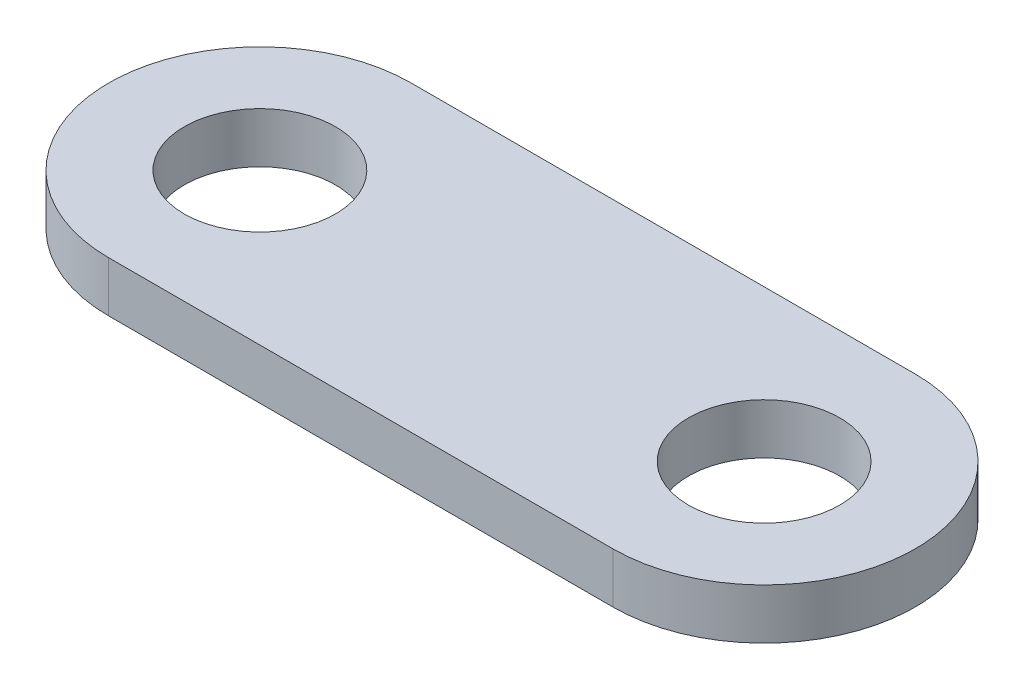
from build123d import *

# Parameters (mm, degrees)
SKETCH1_R      = 7.5
EXTRUDE1_DEPTH = 5


with BuildPart() as part:
    # Sketch1 → Extrude1 (new body)
    with BuildSketch(Plane(origin=(0, 0, 0), x_dir=(1, 0, 0), z_dir=(0, 1, 0))):
        with BuildLine():
            Line((0, 0), (50, 0))
            ThreePointArc((50, 0), (65, 15), (50, 30))
            Line((50, 30), (0, 30))
            ThreePointArc((0, 30), (-15, 15), (0, 0))
        make_face()
        with Locations(Location((50, 15, 0), (0, 0, 270))):
            Circle(SKETCH1_R, mode=Mode.SUBTRACT)
        with Locations(Location((0, 15, 0), (0, 0, 270))):
            Circle(SKETCH1_R, mode=Mode.SUBTRACT)
    extrude(amount=EXTRUDE1_DEPTH)


solid = part.part
